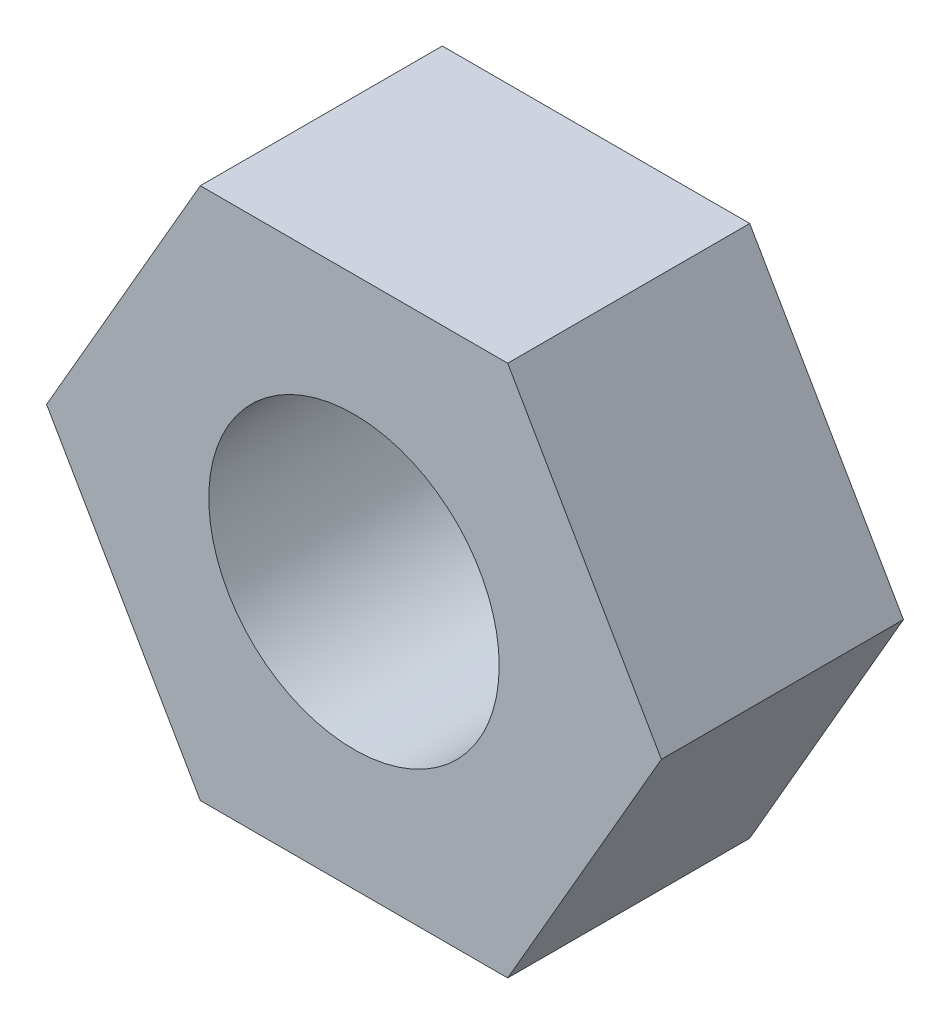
from build123d import *

# Parameters (mm, degrees)
SKETCH_1_R      = 1.5
EXTRUDE_1_DEPTH = 2.5


with BuildPart() as part:
    # Sketch 1 → Extrude 1 (new body)
    with BuildSketch(Plane.XY):
        Polygon((3.175426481, 0), (1.58771324, 2.75), (-1.58771324, 2.75), (-3.175426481, 0), (-1.58771324, -2.75), (1.58771324, -2.75), align=None)
        Circle(SKETCH_1_R, mode=Mode.SUBTRACT)
    extrude(amount=EXTRUDE_1_DEPTH)


solid = part.part
